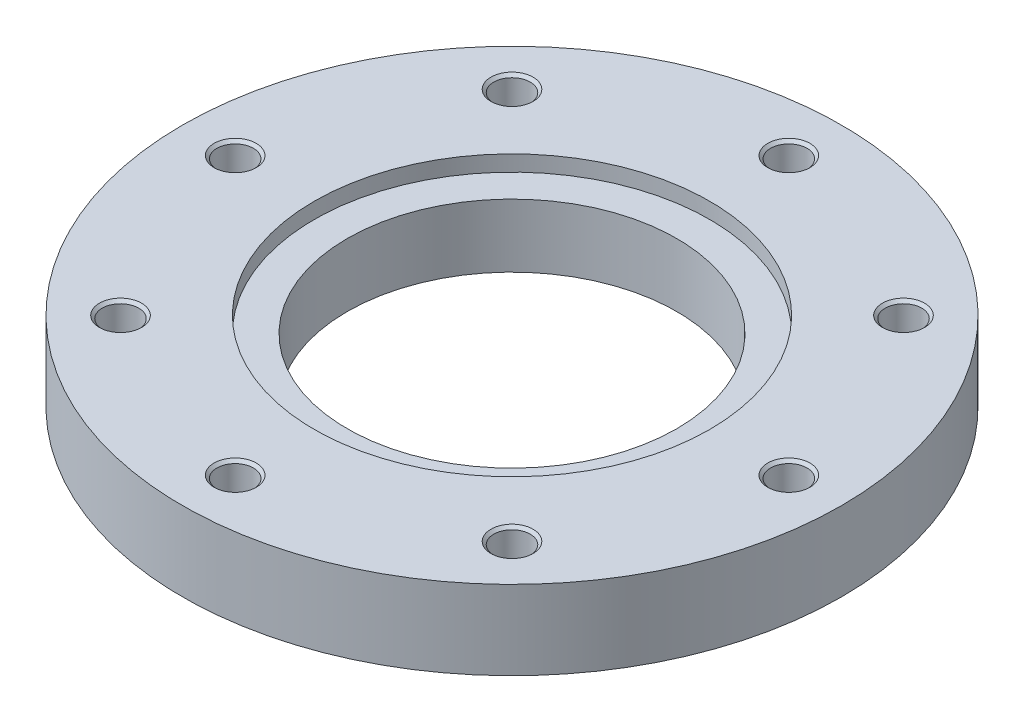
ISO-10303-21;
HEADER;
FILE_DESCRIPTION(('STEP AP214'),'2;1');
FILE_NAME('part.step','',(''),(''),'','','');
FILE_SCHEMA(('AUTOMOTIVE_DESIGN { 1 0 10303 214 1 1 1 1 }'));
ENDSEC;
DATA;
#1=APPLICATION_CONTEXT('core data for automotive mechanical design processes');
#2=APPLICATION_PROTOCOL_DEFINITION('international standard','automotive_design',2000,#1);
#3=PRODUCT_CONTEXT('',#1,'mechanical');
#4=PRODUCT('Part','Part','',(#3));
#5=PRODUCT_RELATED_PRODUCT_CATEGORY('part','',(#4));
#6=PRODUCT_DEFINITION_FORMATION('','',#4);
#7=PRODUCT_DEFINITION_CONTEXT('part definition',#1,'design');
#8=PRODUCT_DEFINITION('design','',#6,#7);
#9=PRODUCT_DEFINITION_SHAPE('','',#8);
#10=(LENGTH_UNIT() NAMED_UNIT(*) SI_UNIT(.MILLI.,.METRE.));
#11=(NAMED_UNIT(*) PLANE_ANGLE_UNIT() SI_UNIT($,.RADIAN.));
#12=(NAMED_UNIT(*) SI_UNIT($,.STERADIAN.) SOLID_ANGLE_UNIT());
#13=UNCERTAINTY_MEASURE_WITH_UNIT(LENGTH_MEASURE(1.E-05),#10,'distance_accuracy_value','');
#14=(GEOMETRIC_REPRESENTATION_CONTEXT(3) GLOBAL_UNCERTAINTY_ASSIGNED_CONTEXT((#13)) GLOBAL_UNIT_ASSIGNED_CONTEXT((#10,
#11,#12)) REPRESENTATION_CONTEXT('',''));
#15=CARTESIAN_POINT('',(0.,0.,0.));
#16=DIRECTION('',(0.,0.,1.));
#17=DIRECTION('',(1.,0.,0.));
#18=AXIS2_PLACEMENT_3D('',#15,#16,#17);
#19=CARTESIAN_POINT('',(0.,15.,0.));
#20=DIRECTION('',(0.,-1.,0.));
#21=DIRECTION('',(1.,0.,0.));
#22=AXIS2_PLACEMENT_3D('',#19,#20,#21);
#23=CYLINDRICAL_SURFACE('',#22,125.);
#24=CARTESIAN_POINT('',(0.,0.,0.));
#25=DIRECTION('',(0.,1.,0.));
#26=DIRECTION('',(1.,0.,0.));
#27=AXIS2_PLACEMENT_3D('',#24,#25,#26);
#28=CIRCLE('',#27,125.);
#29=CARTESIAN_POINT('',(125.,0.,0.));
#30=VERTEX_POINT('',#29);
#31=EDGE_CURVE('E9',#30,#30,#28,.T.);
#32=ORIENTED_EDGE('',*,*,#31,.T.);
#33=EDGE_LOOP('',(#32));
#34=FACE_BOUND('',#33,.T.);
#35=CARTESIAN_POINT('',(0.,30.,0.));
#36=DIRECTION('',(0.,1.,0.));
#37=DIRECTION('',(1.,0.,0.));
#38=AXIS2_PLACEMENT_3D('',#35,#36,#37);
#39=CIRCLE('',#38,125.);
#40=CARTESIAN_POINT('',(125.,30.,0.));
#41=VERTEX_POINT('',#40);
#42=EDGE_CURVE('E149',#41,#41,#39,.T.);
#43=ORIENTED_EDGE('',*,*,#42,.F.);
#44=EDGE_LOOP('',(#43));
#45=FACE_BOUND('',#44,.T.);
#46=ADVANCED_FACE('F15',(#34,#45),#23,.T.);
#47=CARTESIAN_POINT('',(93.75,0.,0.));
#48=DIRECTION('',(0.,-1.,0.));
#49=DIRECTION('',(-1.,0.,0.));
#50=AXIS2_PLACEMENT_3D('',#47,#48,#49);
#51=PLANE('',#50);
#52=CARTESIAN_POINT('',(0.,0.,0.));
#53=DIRECTION('',(0.,1.,0.));
#54=DIRECTION('',(1.,0.,0.));
#55=AXIS2_PLACEMENT_3D('',#52,#53,#54);
#56=CIRCLE('',#55,62.5);
#57=CARTESIAN_POINT('',(62.5,0.,0.));
#58=VERTEX_POINT('',#57);
#59=EDGE_CURVE('E23',#58,#58,#56,.T.);
#60=ORIENTED_EDGE('',*,*,#59,.T.);
#61=EDGE_LOOP('',(#60));
#62=FACE_BOUND('',#61,.T.);
#63=ORIENTED_EDGE('',*,*,#31,.F.);
#64=EDGE_LOOP('',(#63));
#65=FACE_BOUND('',#64,.T.);
#66=ADVANCED_FACE('F234',(#62,#65),#51,.T.);
#67=CARTESIAN_POINT('',(0.,15.,0.));
#68=DIRECTION('',(0.,-1.,0.));
#69=DIRECTION('',(1.,0.,0.));
#70=AXIS2_PLACEMENT_3D('',#67,#68,#69);
#71=CYLINDRICAL_SURFACE('',#70,62.5);
#72=ORIENTED_EDGE('',*,*,#59,.F.);
#73=EDGE_LOOP('',(#72));
#74=FACE_BOUND('',#73,.T.);
#75=CARTESIAN_POINT('',(0.,24.,0.));
#76=DIRECTION('',(0.,1.,0.));
#77=DIRECTION('',(1.,0.,0.));
#78=AXIS2_PLACEMENT_3D('',#75,#76,#77);
#79=CIRCLE('',#78,62.5);
#80=CARTESIAN_POINT('',(-62.5,24.,0.));
#81=VERTEX_POINT('',#80);
#82=EDGE_CURVE('E145',#81,#81,#79,.T.);
#83=ORIENTED_EDGE('',*,*,#82,.T.);
#84=EDGE_LOOP('',(#83));
#85=FACE_BOUND('',#84,.T.);
#86=ADVANCED_FACE('F238',(#74,#85),#71,.F.);
#87=CARTESIAN_POINT('',(93.75,30.,0.));
#88=DIRECTION('',(0.,1.,0.));
#89=DIRECTION('',(1.,0.,0.));
#90=AXIS2_PLACEMENT_3D('',#87,#88,#89);
#91=PLANE('',#90);
#92=ORIENTED_EDGE('',*,*,#42,.T.);
#93=EDGE_LOOP('',(#92));
#94=FACE_BOUND('',#93,.T.);
#95=CARTESIAN_POINT('',(0.,30.,0.));
#96=DIRECTION('',(0.,-1.,0.));
#97=DIRECTION('',(1.,0.,0.));
#98=AXIS2_PLACEMENT_3D('',#95,#96,#97);
#99=CIRCLE('',#98,75.);
#100=CARTESIAN_POINT('',(-75.,30.,0.));
#101=VERTEX_POINT('',#100);
#102=EDGE_CURVE('E246',#101,#101,#99,.T.);
#103=ORIENTED_EDGE('',*,*,#102,.T.);
#104=EDGE_LOOP('',(#103));
#105=FACE_BOUND('',#104,.T.);
#106=CARTESIAN_POINT('',(105.,30.,0.));
#107=DIRECTION('',(0.,-1.,0.));
#108=DIRECTION('',(1.,0.,0.));
#109=AXIS2_PLACEMENT_3D('',#106,#107,#108);
#110=CIRCLE('',#109,8.);
#111=CARTESIAN_POINT('',(113.,30.,0.));
#112=VERTEX_POINT('',#111);
#113=EDGE_CURVE('E254',#112,#112,#110,.T.);
#114=ORIENTED_EDGE('',*,*,#113,.T.);
#115=EDGE_LOOP('',(#114));
#116=FACE_BOUND('',#115,.T.);
#117=CARTESIAN_POINT('',(74.2462120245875,30.,-74.2462120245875));
#118=DIRECTION('',(0.,-1.,0.));
#119=DIRECTION('',(0.707106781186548,0.,-0.707106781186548));
#120=AXIS2_PLACEMENT_3D('',#117,#118,#119);
#121=CIRCLE('',#120,8.);
#122=CARTESIAN_POINT('',(79.9030662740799,30.,-79.9030662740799));
#123=VERTEX_POINT('',#122);
#124=EDGE_CURVE('E265',#123,#123,#121,.T.);
#125=ORIENTED_EDGE('',*,*,#124,.T.);
#126=EDGE_LOOP('',(#125));
#127=FACE_BOUND('',#126,.T.);
#128=CARTESIAN_POINT('',(0.,30.,-105.));
#129=DIRECTION('',(0.,-1.,0.));
#130=DIRECTION('',(0.,0.,-1.));
#131=AXIS2_PLACEMENT_3D('',#128,#129,#130);
#132=CIRCLE('',#131,8.);
#133=CARTESIAN_POINT('',(0.,30.,-113.));
#134=VERTEX_POINT('',#133);
#135=EDGE_CURVE('E276',#134,#134,#132,.T.);
#136=ORIENTED_EDGE('',*,*,#135,.T.);
#137=EDGE_LOOP('',(#136));
#138=FACE_BOUND('',#137,.T.);
#139=CARTESIAN_POINT('',(-74.2462120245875,30.,-74.2462120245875));
#140=DIRECTION('',(0.,-1.,0.));
#141=DIRECTION('',(-0.707106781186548,0.,-0.707106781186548));
#142=AXIS2_PLACEMENT_3D('',#139,#140,#141);
#143=CIRCLE('',#142,8.);
#144=CARTESIAN_POINT('',(-79.9030662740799,30.,-79.9030662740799));
#145=VERTEX_POINT('',#144);
#146=EDGE_CURVE('E289',#145,#145,#143,.T.);
#147=ORIENTED_EDGE('',*,*,#146,.T.);
#148=EDGE_LOOP('',(#147));
#149=FACE_BOUND('',#148,.T.);
#150=CARTESIAN_POINT('',(-105.,30.,0.));
#151=DIRECTION('',(0.,-1.,0.));
#152=DIRECTION('',(-1.,0.,0.));
#153=AXIS2_PLACEMENT_3D('',#150,#151,#152);
#154=CIRCLE('',#153,8.);
#155=CARTESIAN_POINT('',(-113.,30.,0.));
#156=VERTEX_POINT('',#155);
#157=EDGE_CURVE('E304',#156,#156,#154,.T.);
#158=ORIENTED_EDGE('',*,*,#157,.T.);
#159=EDGE_LOOP('',(#158));
#160=FACE_BOUND('',#159,.T.);
#161=CARTESIAN_POINT('',(-74.2462120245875,30.,74.2462120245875));
#162=DIRECTION('',(0.,-1.,0.));
#163=DIRECTION('',(-0.707106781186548,0.,0.707106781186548));
#164=AXIS2_PLACEMENT_3D('',#161,#162,#163);
#165=CIRCLE('',#164,8.);
#166=CARTESIAN_POINT('',(-79.9030662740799,30.,79.9030662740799));
#167=VERTEX_POINT('',#166);
#168=EDGE_CURVE('E316',#167,#167,#165,.T.);
#169=ORIENTED_EDGE('',*,*,#168,.T.);
#170=EDGE_LOOP('',(#169));
#171=FACE_BOUND('',#170,.T.);
#172=CARTESIAN_POINT('',(0.,30.,105.));
#173=DIRECTION('',(0.,-1.,0.));
#174=DIRECTION('',(0.,0.,1.));
#175=AXIS2_PLACEMENT_3D('',#172,#173,#174);
#176=CIRCLE('',#175,8.);
#177=CARTESIAN_POINT('',(0.,30.,113.));
#178=VERTEX_POINT('',#177);
#179=EDGE_CURVE('E324',#178,#178,#176,.T.);
#180=ORIENTED_EDGE('',*,*,#179,.T.);
#181=EDGE_LOOP('',(#180));
#182=FACE_BOUND('',#181,.T.);
#183=CARTESIAN_POINT('',(74.2462120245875,30.,74.2462120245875));
#184=DIRECTION('',(0.,-1.,0.));
#185=DIRECTION('',(0.707106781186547,0.,0.707106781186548));
#186=AXIS2_PLACEMENT_3D('',#183,#184,#185);
#187=CIRCLE('',#186,8.);
#188=CARTESIAN_POINT('',(79.9030662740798,30.,79.9030662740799));
#189=VERTEX_POINT('',#188);
#190=EDGE_CURVE('E336',#189,#189,#187,.T.);
#191=ORIENTED_EDGE('',*,*,#190,.T.);
#192=EDGE_LOOP('',(#191));
#193=FACE_BOUND('',#192,.T.);
#194=ADVANCED_FACE('F345',(#94,#105,#116,#127,#138,#149,#160,#171,#182,#193),#91,.T.);
#195=CARTESIAN_POINT('',(0.,24.,0.));
#196=DIRECTION('',(0.,-1.,0.));
#197=DIRECTION('',(-1.,0.,0.));
#198=AXIS2_PLACEMENT_3D('',#195,#196,#197);
#199=PLANE('',#198);
#200=CARTESIAN_POINT('',(0.,24.,0.));
#201=DIRECTION('',(0.,-1.,0.));
#202=DIRECTION('',(1.,0.,0.));
#203=AXIS2_PLACEMENT_3D('',#200,#201,#202);
#204=CIRCLE('',#203,75.);
#205=CARTESIAN_POINT('',(75.,24.,0.));
#206=VERTEX_POINT('',#205);
#207=EDGE_CURVE('E242',#206,#206,#204,.T.);
#208=ORIENTED_EDGE('',*,*,#207,.F.);
#209=EDGE_LOOP('',(#208));
#210=FACE_BOUND('',#209,.T.);
#211=ORIENTED_EDGE('',*,*,#82,.F.);
#212=EDGE_LOOP('',(#211));
#213=FACE_BOUND('',#212,.T.);
#214=ADVANCED_FACE('F800',(#210,#213),#199,.F.);
#215=CARTESIAN_POINT('',(0.,28.5,0.));
#216=DIRECTION('',(0.,-1.,0.));
#217=DIRECTION('',(1.,0.,0.));
#218=AXIS2_PLACEMENT_3D('',#215,#216,#217);
#219=CYLINDRICAL_SURFACE('',#218,75.);
#220=ORIENTED_EDGE('',*,*,#207,.T.);
#221=EDGE_LOOP('',(#220));
#222=FACE_BOUND('',#221,.T.);
#223=ORIENTED_EDGE('',*,*,#102,.F.);
#224=EDGE_LOOP('',(#223));
#225=FACE_BOUND('',#224,.T.);
#226=ADVANCED_FACE('F791',(#222,#225),#219,.F.);
#227=CARTESIAN_POINT('',(105.,5.00308975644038,0.));
#228=DIRECTION('',(0.,1.,0.));
#229=DIRECTION('',(1.,0.,0.));
#230=AXIS2_PLACEMENT_3D('',#227,#228,#229);
#231=CONICAL_SURFACE('',#230,3.45875,1.0471975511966);
#232=CARTESIAN_POINT('',(105.,7.,0.));
#233=DIRECTION('',(0.,-1.,0.));
#234=DIRECTION('',(1.,0.,0.));
#235=AXIS2_PLACEMENT_3D('',#232,#233,#234);
#236=CIRCLE('',#235,6.9175);
#237=CARTESIAN_POINT('',(111.9175,7.,0.));
#238=VERTEX_POINT('',#237);
#239=EDGE_CURVE('E248',#238,#238,#236,.T.);
#240=ORIENTED_EDGE('',*,*,#239,.F.);
#241=EDGE_LOOP('',(#240));
#242=FACE_BOUND('',#241,.T.);
#243=CARTESIAN_POINT('',(105.,3.00617951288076,0.));
#244=VERTEX_POINT('',#243);
#245=VERTEX_LOOP('',#244);
#246=FACE_BOUND('',#245,.T.);
#247=ADVANCED_FACE('F782',(#242,#246),#231,.F.);
#248=CARTESIAN_POINT('',(105.,9.95875,0.));
#249=DIRECTION('',(0.,1.,0.));
#250=DIRECTION('',(1.,0.,0.));
#251=AXIS2_PLACEMENT_3D('',#248,#249,#250);
#252=CYLINDRICAL_SURFACE('',#251,6.9175);
#253=CARTESIAN_POINT('',(105.,12.9175,0.));
#254=DIRECTION('',(0.,-1.,0.));
#255=DIRECTION('',(1.,0.,0.));
#256=AXIS2_PLACEMENT_3D('',#253,#254,#255);
#257=CIRCLE('',#256,6.9175);
#258=CARTESIAN_POINT('',(111.9175,12.9175,0.));
#259=VERTEX_POINT('',#258);
#260=EDGE_CURVE('E250',#259,#259,#257,.T.);
#261=ORIENTED_EDGE('',*,*,#260,.F.);
#262=EDGE_LOOP('',(#261));
#263=FACE_BOUND('',#262,.T.);
#264=ORIENTED_EDGE('',*,*,#239,.T.);
#265=EDGE_LOOP('',(#264));
#266=FACE_BOUND('',#265,.T.);
#267=ADVANCED_FACE('F773',(#263,#266),#252,.F.);
#268=CARTESIAN_POINT('',(105.,13.45875,0.));
#269=DIRECTION('',(0.,1.,0.));
#270=DIRECTION('',(1.,0.,0.));
#271=AXIS2_PLACEMENT_3D('',#268,#269,#270);
#272=CONICAL_SURFACE('',#271,7.45875,0.785398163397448);
#273=CARTESIAN_POINT('',(105.,14.,0.));
#274=DIRECTION('',(0.,-1.,0.));
#275=DIRECTION('',(1.,0.,0.));
#276=AXIS2_PLACEMENT_3D('',#273,#274,#275);
#277=CIRCLE('',#276,8.);
#278=CARTESIAN_POINT('',(113.,14.,0.));
#279=VERTEX_POINT('',#278);
#280=EDGE_CURVE('E251',#279,#279,#277,.T.);
#281=ORIENTED_EDGE('',*,*,#280,.F.);
#282=EDGE_LOOP('',(#281));
#283=FACE_BOUND('',#282,.T.);
#284=ORIENTED_EDGE('',*,*,#260,.T.);
#285=EDGE_LOOP('',(#284));
#286=FACE_BOUND('',#285,.T.);
#287=ADVANCED_FACE('F764',(#283,#286),#272,.F.);
#288=CARTESIAN_POINT('',(112.45875,14.,0.));
#289=DIRECTION('',(0.,1.,0.));
#290=DIRECTION('',(-1.,0.,0.));
#291=AXIS2_PLACEMENT_3D('',#288,#289,#290);
#292=PLANE('',#291);
#293=CARTESIAN_POINT('',(105.,14.,0.));
#294=DIRECTION('',(0.,-1.,0.));
#295=DIRECTION('',(1.,0.,0.));
#296=AXIS2_PLACEMENT_3D('',#293,#294,#295);
#297=CIRCLE('',#296,6.9175);
#298=CARTESIAN_POINT('',(111.9175,14.,0.));
#299=VERTEX_POINT('',#298);
#300=EDGE_CURVE('E253',#299,#299,#297,.T.);
#301=ORIENTED_EDGE('',*,*,#300,.F.);
#302=EDGE_LOOP('',(#301));
#303=FACE_BOUND('',#302,.T.);
#304=ORIENTED_EDGE('',*,*,#280,.T.);
#305=EDGE_LOOP('',(#304));
#306=FACE_BOUND('',#305,.T.);
#307=ADVANCED_FACE('F755',(#303,#306),#292,.F.);
#308=CARTESIAN_POINT('',(105.,21.45875,0.));
#309=DIRECTION('',(0.,1.,0.));
#310=DIRECTION('',(1.,0.,0.));
#311=AXIS2_PLACEMENT_3D('',#308,#309,#310);
#312=CYLINDRICAL_SURFACE('',#311,6.9175);
#313=CARTESIAN_POINT('',(105.,28.9175,0.));
#314=DIRECTION('',(0.,-1.,0.));
#315=DIRECTION('',(1.,0.,0.));
#316=AXIS2_PLACEMENT_3D('',#313,#314,#315);
#317=CIRCLE('',#316,6.9175);
#318=CARTESIAN_POINT('',(111.9175,28.9175,0.));
#319=VERTEX_POINT('',#318);
#320=EDGE_CURVE('E256',#319,#319,#317,.T.);
#321=ORIENTED_EDGE('',*,*,#320,.F.);
#322=EDGE_LOOP('',(#321));
#323=FACE_BOUND('',#322,.T.);
#324=ORIENTED_EDGE('',*,*,#300,.T.);
#325=EDGE_LOOP('',(#324));
#326=FACE_BOUND('',#325,.T.);
#327=ADVANCED_FACE('F746',(#323,#326),#312,.F.);
#328=CARTESIAN_POINT('',(105.,29.45875,0.));
#329=DIRECTION('',(0.,1.,0.));
#330=DIRECTION('',(1.,0.,0.));
#331=AXIS2_PLACEMENT_3D('',#328,#329,#330);
#332=CONICAL_SURFACE('',#331,7.45875,0.785398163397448);
#333=ORIENTED_EDGE('',*,*,#113,.F.);
#334=EDGE_LOOP('',(#333));
#335=FACE_BOUND('',#334,.T.);
#336=ORIENTED_EDGE('',*,*,#320,.T.);
#337=EDGE_LOOP('',(#336));
#338=FACE_BOUND('',#337,.T.);
#339=ADVANCED_FACE('F737',(#335,#338),#332,.F.);
#340=CARTESIAN_POINT('',(74.2462120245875,5.00308975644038,-74.2462120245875));
#341=DIRECTION('',(0.,1.,0.));
#342=DIRECTION('',(0.707106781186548,0.,-0.707106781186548));
#343=AXIS2_PLACEMENT_3D('',#340,#341,#342);
#344=CONICAL_SURFACE('',#343,3.45875,1.0471975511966);
#345=CARTESIAN_POINT('',(74.2462120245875,7.,-74.2462120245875));
#346=DIRECTION('',(0.,-1.,0.));
#347=DIRECTION('',(0.707106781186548,0.,-0.707106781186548));
#348=AXIS2_PLACEMENT_3D('',#345,#346,#347);
#349=CIRCLE('',#348,6.9175);
#350=CARTESIAN_POINT('',(79.1376231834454,7.,-79.1376231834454));
#351=VERTEX_POINT('',#350);
#352=EDGE_CURVE('E258',#351,#351,#349,.T.);
#353=ORIENTED_EDGE('',*,*,#352,.F.);
#354=EDGE_LOOP('',(#353));
#355=FACE_BOUND('',#354,.T.);
#356=CARTESIAN_POINT('',(74.2462120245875,3.00617951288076,-74.2462120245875));
#357=VERTEX_POINT('',#356);
#358=VERTEX_LOOP('',#357);
#359=FACE_BOUND('',#358,.T.);
#360=ADVANCED_FACE('F728',(#355,#359),#344,.F.);
#361=CARTESIAN_POINT('',(74.2462120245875,9.95875,-74.2462120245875));
#362=DIRECTION('',(0.,1.,0.));
#363=DIRECTION('',(0.707106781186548,0.,-0.707106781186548));
#364=AXIS2_PLACEMENT_3D('',#361,#362,#363);
#365=CYLINDRICAL_SURFACE('',#364,6.9175);
#366=CARTESIAN_POINT('',(74.2462120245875,12.9175,-74.2462120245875));
#367=DIRECTION('',(0.,-1.,0.));
#368=DIRECTION('',(0.707106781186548,0.,-0.707106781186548));
#369=AXIS2_PLACEMENT_3D('',#366,#367,#368);
#370=CIRCLE('',#369,6.9175);
#371=CARTESIAN_POINT('',(79.1376231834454,12.9175,-79.1376231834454));
#372=VERTEX_POINT('',#371);
#373=EDGE_CURVE('E260',#372,#372,#370,.T.);
#374=ORIENTED_EDGE('',*,*,#373,.F.);
#375=EDGE_LOOP('',(#374));
#376=FACE_BOUND('',#375,.T.);
#377=ORIENTED_EDGE('',*,*,#352,.T.);
#378=EDGE_LOOP('',(#377));
#379=FACE_BOUND('',#378,.T.);
#380=ADVANCED_FACE('F719',(#376,#379),#365,.F.);
#381=CARTESIAN_POINT('',(74.2462120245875,13.45875,-74.2462120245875));
#382=DIRECTION('',(0.,1.,0.));
#383=DIRECTION('',(0.707106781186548,0.,-0.707106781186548));
#384=AXIS2_PLACEMENT_3D('',#381,#382,#383);
#385=CONICAL_SURFACE('',#384,7.45875,0.785398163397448);
#386=CARTESIAN_POINT('',(74.2462120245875,14.,-74.2462120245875));
#387=DIRECTION('',(0.,-1.,0.));
#388=DIRECTION('',(0.707106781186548,0.,-0.707106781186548));
#389=AXIS2_PLACEMENT_3D('',#386,#387,#388);
#390=CIRCLE('',#389,8.);
#391=CARTESIAN_POINT('',(79.9030662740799,14.,-79.9030662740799));
#392=VERTEX_POINT('',#391);
#393=EDGE_CURVE('E261',#392,#392,#390,.T.);
#394=ORIENTED_EDGE('',*,*,#393,.F.);
#395=EDGE_LOOP('',(#394));
#396=FACE_BOUND('',#395,.T.);
#397=ORIENTED_EDGE('',*,*,#373,.T.);
#398=EDGE_LOOP('',(#397));
#399=FACE_BOUND('',#398,.T.);
#400=ADVANCED_FACE('F710',(#396,#399),#385,.F.);
#401=CARTESIAN_POINT('',(79.5203447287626,14.,-79.5203447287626));
#402=DIRECTION('',(0.,1.,0.));
#403=DIRECTION('',(-0.707106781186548,0.,0.707106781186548));
#404=AXIS2_PLACEMENT_3D('',#401,#402,#403);
#405=PLANE('',#404);
#406=CARTESIAN_POINT('',(74.2462120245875,14.,-74.2462120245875));
#407=DIRECTION('',(0.,-1.,0.));
#408=DIRECTION('',(0.707106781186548,0.,-0.707106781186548));
#409=AXIS2_PLACEMENT_3D('',#406,#407,#408);
#410=CIRCLE('',#409,6.9175);
#411=CARTESIAN_POINT('',(79.1376231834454,14.,-79.1376231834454));
#412=VERTEX_POINT('',#411);
#413=EDGE_CURVE('E263',#412,#412,#410,.T.);
#414=ORIENTED_EDGE('',*,*,#413,.F.);
#415=EDGE_LOOP('',(#414));
#416=FACE_BOUND('',#415,.T.);
#417=ORIENTED_EDGE('',*,*,#393,.T.);
#418=EDGE_LOOP('',(#417));
#419=FACE_BOUND('',#418,.T.);
#420=ADVANCED_FACE('F701',(#416,#419),#405,.F.);
#421=CARTESIAN_POINT('',(74.2462120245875,21.45875,-74.2462120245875));
#422=DIRECTION('',(0.,1.,0.));
#423=DIRECTION('',(0.707106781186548,0.,-0.707106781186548));
#424=AXIS2_PLACEMENT_3D('',#421,#422,#423);
#425=CYLINDRICAL_SURFACE('',#424,6.9175);
#426=CARTESIAN_POINT('',(74.2462120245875,28.9175,-74.2462120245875));
#427=DIRECTION('',(0.,-1.,0.));
#428=DIRECTION('',(0.707106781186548,0.,-0.707106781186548));
#429=AXIS2_PLACEMENT_3D('',#426,#427,#428);
#430=CIRCLE('',#429,6.9175);
#431=CARTESIAN_POINT('',(79.1376231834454,28.9175,-79.1376231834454));
#432=VERTEX_POINT('',#431);
#433=EDGE_CURVE('E267',#432,#432,#430,.T.);
#434=ORIENTED_EDGE('',*,*,#433,.F.);
#435=EDGE_LOOP('',(#434));
#436=FACE_BOUND('',#435,.T.);
#437=ORIENTED_EDGE('',*,*,#413,.T.);
#438=EDGE_LOOP('',(#437));
#439=FACE_BOUND('',#438,.T.);
#440=ADVANCED_FACE('F692',(#436,#439),#425,.F.);
#441=CARTESIAN_POINT('',(74.2462120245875,29.45875,-74.2462120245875));
#442=DIRECTION('',(0.,1.,0.));
#443=DIRECTION('',(0.707106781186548,0.,-0.707106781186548));
#444=AXIS2_PLACEMENT_3D('',#441,#442,#443);
#445=CONICAL_SURFACE('',#444,7.45875,0.785398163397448);
#446=ORIENTED_EDGE('',*,*,#124,.F.);
#447=EDGE_LOOP('',(#446));
#448=FACE_BOUND('',#447,.T.);
#449=ORIENTED_EDGE('',*,*,#433,.T.);
#450=EDGE_LOOP('',(#449));
#451=FACE_BOUND('',#450,.T.);
#452=ADVANCED_FACE('F683',(#448,#451),#445,.F.);
#453=CARTESIAN_POINT('',(0.,5.00308975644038,-105.));
#454=DIRECTION('',(0.,1.,0.));
#455=DIRECTION('',(0.,0.,-1.));
#456=AXIS2_PLACEMENT_3D('',#453,#454,#455);
#457=CONICAL_SURFACE('',#456,3.45875,1.0471975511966);
#458=CARTESIAN_POINT('',(0.,7.,-105.));
#459=DIRECTION('',(0.,-1.,0.));
#460=DIRECTION('',(0.,0.,-1.));
#461=AXIS2_PLACEMENT_3D('',#458,#459,#460);
#462=CIRCLE('',#461,6.9175);
#463=CARTESIAN_POINT('',(0.,7.,-111.9175));
#464=VERTEX_POINT('',#463);
#465=EDGE_CURVE('E269',#464,#464,#462,.T.);
#466=ORIENTED_EDGE('',*,*,#465,.F.);
#467=EDGE_LOOP('',(#466));
#468=FACE_BOUND('',#467,.T.);
#469=CARTESIAN_POINT('',(0.,3.00617951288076,-105.));
#470=VERTEX_POINT('',#469);
#471=VERTEX_LOOP('',#470);
#472=FACE_BOUND('',#471,.T.);
#473=ADVANCED_FACE('F674',(#468,#472),#457,.F.);
#474=CARTESIAN_POINT('',(0.,9.95875,-105.));
#475=DIRECTION('',(0.,1.,0.));
#476=DIRECTION('',(0.,0.,-1.));
#477=AXIS2_PLACEMENT_3D('',#474,#475,#476);
#478=CYLINDRICAL_SURFACE('',#477,6.9175);
#479=CARTESIAN_POINT('',(0.,12.9175,-105.));
#480=DIRECTION('',(0.,-1.,0.));
#481=DIRECTION('',(0.,0.,-1.));
#482=AXIS2_PLACEMENT_3D('',#479,#480,#481);
#483=CIRCLE('',#482,6.9175);
#484=CARTESIAN_POINT('',(0.,12.9175,-111.9175));
#485=VERTEX_POINT('',#484);
#486=EDGE_CURVE('E271',#485,#485,#483,.T.);
#487=ORIENTED_EDGE('',*,*,#486,.F.);
#488=EDGE_LOOP('',(#487));
#489=FACE_BOUND('',#488,.T.);
#490=ORIENTED_EDGE('',*,*,#465,.T.);
#491=EDGE_LOOP('',(#490));
#492=FACE_BOUND('',#491,.T.);
#493=ADVANCED_FACE('F665',(#489,#492),#478,.F.);
#494=CARTESIAN_POINT('',(0.,13.45875,-105.));
#495=DIRECTION('',(0.,1.,0.));
#496=DIRECTION('',(0.,0.,-1.));
#497=AXIS2_PLACEMENT_3D('',#494,#495,#496);
#498=CONICAL_SURFACE('',#497,7.45875,0.785398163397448);
#499=CARTESIAN_POINT('',(0.,14.,-105.));
#500=DIRECTION('',(0.,-1.,0.));
#501=DIRECTION('',(0.,0.,-1.));
#502=AXIS2_PLACEMENT_3D('',#499,#500,#501);
#503=CIRCLE('',#502,8.);
#504=CARTESIAN_POINT('',(0.,14.,-113.));
#505=VERTEX_POINT('',#504);
#506=EDGE_CURVE('E273',#505,#505,#503,.T.);
#507=ORIENTED_EDGE('',*,*,#506,.F.);
#508=EDGE_LOOP('',(#507));
#509=FACE_BOUND('',#508,.T.);
#510=ORIENTED_EDGE('',*,*,#486,.T.);
#511=EDGE_LOOP('',(#510));
#512=FACE_BOUND('',#511,.T.);
#513=ADVANCED_FACE('F656',(#509,#512),#498,.F.);
#514=CARTESIAN_POINT('',(0.,14.,-112.45875));
#515=DIRECTION('',(0.,1.,0.));
#516=DIRECTION('',(0.,0.,1.));
#517=AXIS2_PLACEMENT_3D('',#514,#515,#516);
#518=PLANE('',#517);
#519=CARTESIAN_POINT('',(0.,14.,-105.));
#520=DIRECTION('',(0.,-1.,0.));
#521=DIRECTION('',(0.,0.,-1.));
#522=AXIS2_PLACEMENT_3D('',#519,#520,#521);
#523=CIRCLE('',#522,6.9175);
#524=CARTESIAN_POINT('',(0.,14.,-111.9175));
#525=VERTEX_POINT('',#524);
#526=EDGE_CURVE('E275',#525,#525,#523,.T.);
#527=ORIENTED_EDGE('',*,*,#526,.F.);
#528=EDGE_LOOP('',(#527));
#529=FACE_BOUND('',#528,.T.);
#530=ORIENTED_EDGE('',*,*,#506,.T.);
#531=EDGE_LOOP('',(#530));
#532=FACE_BOUND('',#531,.T.);
#533=ADVANCED_FACE('F647',(#529,#532),#518,.F.);
#534=CARTESIAN_POINT('',(0.,21.45875,-105.));
#535=DIRECTION('',(0.,1.,0.));
#536=DIRECTION('',(0.,0.,-1.));
#537=AXIS2_PLACEMENT_3D('',#534,#535,#536);
#538=CYLINDRICAL_SURFACE('',#537,6.9175);
#539=CARTESIAN_POINT('',(0.,28.9175,-105.));
#540=DIRECTION('',(0.,-1.,0.));
#541=DIRECTION('',(0.,0.,-1.));
#542=AXIS2_PLACEMENT_3D('',#539,#540,#541);
#543=CIRCLE('',#542,6.9175);
#544=CARTESIAN_POINT('',(0.,28.9175,-111.9175));
#545=VERTEX_POINT('',#544);
#546=EDGE_CURVE('E279',#545,#545,#543,.T.);
#547=ORIENTED_EDGE('',*,*,#546,.F.);
#548=EDGE_LOOP('',(#547));
#549=FACE_BOUND('',#548,.T.);
#550=ORIENTED_EDGE('',*,*,#526,.T.);
#551=EDGE_LOOP('',(#550));
#552=FACE_BOUND('',#551,.T.);
#553=ADVANCED_FACE('F638',(#549,#552),#538,.F.);
#554=CARTESIAN_POINT('',(0.,29.45875,-105.));
#555=DIRECTION('',(0.,1.,0.));
#556=DIRECTION('',(0.,0.,-1.));
#557=AXIS2_PLACEMENT_3D('',#554,#555,#556);
#558=CONICAL_SURFACE('',#557,7.45875,0.785398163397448);
#559=ORIENTED_EDGE('',*,*,#135,.F.);
#560=EDGE_LOOP('',(#559));
#561=FACE_BOUND('',#560,.T.);
#562=ORIENTED_EDGE('',*,*,#546,.T.);
#563=EDGE_LOOP('',(#562));
#564=FACE_BOUND('',#563,.T.);
#565=ADVANCED_FACE('F629',(#561,#564),#558,.F.);
#566=CARTESIAN_POINT('',(-74.2462120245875,5.00308975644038,-74.2462120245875));
#567=DIRECTION('',(0.,1.,0.));
#568=DIRECTION('',(-0.707106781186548,0.,-0.707106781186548));
#569=AXIS2_PLACEMENT_3D('',#566,#567,#568);
#570=CONICAL_SURFACE('',#569,3.45875,1.0471975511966);
#571=CARTESIAN_POINT('',(-74.2462120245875,7.,-74.2462120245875));
#572=DIRECTION('',(0.,-1.,0.));
#573=DIRECTION('',(-0.707106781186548,0.,-0.707106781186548));
#574=AXIS2_PLACEMENT_3D('',#571,#572,#573);
#575=CIRCLE('',#574,6.9175);
#576=CARTESIAN_POINT('',(-79.1376231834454,7.,-79.1376231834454));
#577=VERTEX_POINT('',#576);
#578=EDGE_CURVE('E281',#577,#577,#575,.T.);
#579=ORIENTED_EDGE('',*,*,#578,.F.);
#580=EDGE_LOOP('',(#579));
#581=FACE_BOUND('',#580,.T.);
#582=CARTESIAN_POINT('',(-74.2462120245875,3.00617951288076,-74.2462120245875));
#583=VERTEX_POINT('',#582);
#584=VERTEX_LOOP('',#583);
#585=FACE_BOUND('',#584,.T.);
#586=ADVANCED_FACE('F620',(#581,#585),#570,.F.);
#587=CARTESIAN_POINT('',(-74.2462120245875,9.95875,-74.2462120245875));
#588=DIRECTION('',(0.,1.,0.));
#589=DIRECTION('',(-0.707106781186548,0.,-0.707106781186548));
#590=AXIS2_PLACEMENT_3D('',#587,#588,#589);
#591=CYLINDRICAL_SURFACE('',#590,6.9175);
#592=CARTESIAN_POINT('',(-74.2462120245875,12.9175,-74.2462120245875));
#593=DIRECTION('',(0.,-1.,0.));
#594=DIRECTION('',(-0.707106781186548,0.,-0.707106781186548));
#595=AXIS2_PLACEMENT_3D('',#592,#593,#594);
#596=CIRCLE('',#595,6.9175);
#597=CARTESIAN_POINT('',(-79.1376231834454,12.9175,-79.1376231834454));
#598=VERTEX_POINT('',#597);
#599=EDGE_CURVE('E283',#598,#598,#596,.T.);
#600=ORIENTED_EDGE('',*,*,#599,.F.);
#601=EDGE_LOOP('',(#600));
#602=FACE_BOUND('',#601,.T.);
#603=ORIENTED_EDGE('',*,*,#578,.T.);
#604=EDGE_LOOP('',(#603));
#605=FACE_BOUND('',#604,.T.);
#606=ADVANCED_FACE('F611',(#602,#605),#591,.F.);
#607=CARTESIAN_POINT('',(-74.2462120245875,13.45875,-74.2462120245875));
#608=DIRECTION('',(0.,1.,0.));
#609=DIRECTION('',(-0.707106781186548,0.,-0.707106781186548));
#610=AXIS2_PLACEMENT_3D('',#607,#608,#609);
#611=CONICAL_SURFACE('',#610,7.45875,0.785398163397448);
#612=CARTESIAN_POINT('',(-74.2462120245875,14.,-74.2462120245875));
#613=DIRECTION('',(0.,-1.,0.));
#614=DIRECTION('',(-0.707106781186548,0.,-0.707106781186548));
#615=AXIS2_PLACEMENT_3D('',#612,#613,#614);
#616=CIRCLE('',#615,8.);
#617=CARTESIAN_POINT('',(-79.9030662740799,14.,-79.9030662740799));
#618=VERTEX_POINT('',#617);
#619=EDGE_CURVE('E285',#618,#618,#616,.T.);
#620=ORIENTED_EDGE('',*,*,#619,.F.);
#621=EDGE_LOOP('',(#620));
#622=FACE_BOUND('',#621,.T.);
#623=ORIENTED_EDGE('',*,*,#599,.T.);
#624=EDGE_LOOP('',(#623));
#625=FACE_BOUND('',#624,.T.);
#626=ADVANCED_FACE('F602',(#622,#625),#611,.F.);
#627=CARTESIAN_POINT('',(-79.5203447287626,14.,-79.5203447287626));
#628=DIRECTION('',(0.,1.,0.));
#629=DIRECTION('',(0.707106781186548,0.,0.707106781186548));
#630=AXIS2_PLACEMENT_3D('',#627,#628,#629);
#631=PLANE('',#630);
#632=CARTESIAN_POINT('',(-74.2462120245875,14.,-74.2462120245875));
#633=DIRECTION('',(0.,-1.,0.));
#634=DIRECTION('',(-0.707106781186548,0.,-0.707106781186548));
#635=AXIS2_PLACEMENT_3D('',#632,#633,#634);
#636=CIRCLE('',#635,6.9175);
#637=CARTESIAN_POINT('',(-79.1376231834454,14.,-79.1376231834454));
#638=VERTEX_POINT('',#637);
#639=EDGE_CURVE('E287',#638,#638,#636,.T.);
#640=ORIENTED_EDGE('',*,*,#639,.F.);
#641=EDGE_LOOP('',(#640));
#642=FACE_BOUND('',#641,.T.);
#643=ORIENTED_EDGE('',*,*,#619,.T.);
#644=EDGE_LOOP('',(#643));
#645=FACE_BOUND('',#644,.T.);
#646=ADVANCED_FACE('F593',(#642,#645),#631,.F.);
#647=CARTESIAN_POINT('',(-74.2462120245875,21.45875,-74.2462120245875));
#648=DIRECTION('',(0.,1.,0.));
#649=DIRECTION('',(-0.707106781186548,0.,-0.707106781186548));
#650=AXIS2_PLACEMENT_3D('',#647,#648,#649);
#651=CYLINDRICAL_SURFACE('',#650,6.9175);
#652=CARTESIAN_POINT('',(-74.2462120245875,28.9175,-74.2462120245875));
#653=DIRECTION('',(0.,-1.,0.));
#654=DIRECTION('',(-0.707106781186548,0.,-0.707106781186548));
#655=AXIS2_PLACEMENT_3D('',#652,#653,#654);
#656=CIRCLE('',#655,6.9175);
#657=CARTESIAN_POINT('',(-79.1376231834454,28.9175,-79.1376231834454));
#658=VERTEX_POINT('',#657);
#659=EDGE_CURVE('E292',#658,#658,#656,.T.);
#660=ORIENTED_EDGE('',*,*,#659,.F.);
#661=EDGE_LOOP('',(#660));
#662=FACE_BOUND('',#661,.T.);
#663=ORIENTED_EDGE('',*,*,#639,.T.);
#664=EDGE_LOOP('',(#663));
#665=FACE_BOUND('',#664,.T.);
#666=ADVANCED_FACE('F584',(#662,#665),#651,.F.);
#667=CARTESIAN_POINT('',(-74.2462120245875,29.45875,-74.2462120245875));
#668=DIRECTION('',(0.,1.,0.));
#669=DIRECTION('',(-0.707106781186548,0.,-0.707106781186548));
#670=AXIS2_PLACEMENT_3D('',#667,#668,#669);
#671=CONICAL_SURFACE('',#670,7.45875,0.785398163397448);
#672=ORIENTED_EDGE('',*,*,#146,.F.);
#673=EDGE_LOOP('',(#672));
#674=FACE_BOUND('',#673,.T.);
#675=ORIENTED_EDGE('',*,*,#659,.T.);
#676=EDGE_LOOP('',(#675));
#677=FACE_BOUND('',#676,.T.);
#678=ADVANCED_FACE('F575',(#674,#677),#671,.F.);
#679=CARTESIAN_POINT('',(-105.,5.00308975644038,0.));
#680=DIRECTION('',(0.,1.,0.));
#681=DIRECTION('',(-1.,0.,0.));
#682=AXIS2_PLACEMENT_3D('',#679,#680,#681);
#683=CONICAL_SURFACE('',#682,3.45875,1.0471975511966);
#684=CARTESIAN_POINT('',(-105.,7.,0.));
#685=DIRECTION('',(0.,-1.,0.));
#686=DIRECTION('',(-1.,0.,0.));
#687=AXIS2_PLACEMENT_3D('',#684,#685,#686);
#688=CIRCLE('',#687,6.9175);
#689=CARTESIAN_POINT('',(-111.9175,7.,0.));
#690=VERTEX_POINT('',#689);
#691=EDGE_CURVE('E295',#690,#690,#688,.T.);
#692=ORIENTED_EDGE('',*,*,#691,.F.);
#693=EDGE_LOOP('',(#692));
#694=FACE_BOUND('',#693,.T.);
#695=CARTESIAN_POINT('',(-105.,3.00617951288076,0.));
#696=VERTEX_POINT('',#695);
#697=VERTEX_LOOP('',#696);
#698=FACE_BOUND('',#697,.T.);
#699=ADVANCED_FACE('F566',(#694,#698),#683,.F.);
#700=CARTESIAN_POINT('',(-105.,9.95875,0.));
#701=DIRECTION('',(0.,1.,0.));
#702=DIRECTION('',(-1.,0.,0.));
#703=AXIS2_PLACEMENT_3D('',#700,#701,#702);
#704=CYLINDRICAL_SURFACE('',#703,6.9175);
#705=CARTESIAN_POINT('',(-105.,12.9175,0.));
#706=DIRECTION('',(0.,-1.,0.));
#707=DIRECTION('',(-1.,0.,0.));
#708=AXIS2_PLACEMENT_3D('',#705,#706,#707);
#709=CIRCLE('',#708,6.9175);
#710=CARTESIAN_POINT('',(-111.9175,12.9175,0.));
#711=VERTEX_POINT('',#710);
#712=EDGE_CURVE('E297',#711,#711,#709,.T.);
#713=ORIENTED_EDGE('',*,*,#712,.F.);
#714=EDGE_LOOP('',(#713));
#715=FACE_BOUND('',#714,.T.);
#716=ORIENTED_EDGE('',*,*,#691,.T.);
#717=EDGE_LOOP('',(#716));
#718=FACE_BOUND('',#717,.T.);
#719=ADVANCED_FACE('F557',(#715,#718),#704,.F.);
#720=CARTESIAN_POINT('',(-105.,13.45875,0.));
#721=DIRECTION('',(0.,1.,0.));
#722=DIRECTION('',(-1.,0.,0.));
#723=AXIS2_PLACEMENT_3D('',#720,#721,#722);
#724=CONICAL_SURFACE('',#723,7.45875,0.785398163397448);
#725=CARTESIAN_POINT('',(-105.,14.,0.));
#726=DIRECTION('',(0.,-1.,0.));
#727=DIRECTION('',(-1.,0.,0.));
#728=AXIS2_PLACEMENT_3D('',#725,#726,#727);
#729=CIRCLE('',#728,8.);
#730=CARTESIAN_POINT('',(-113.,14.,0.));
#731=VERTEX_POINT('',#730);
#732=EDGE_CURVE('E299',#731,#731,#729,.T.);
#733=ORIENTED_EDGE('',*,*,#732,.F.);
#734=EDGE_LOOP('',(#733));
#735=FACE_BOUND('',#734,.T.);
#736=ORIENTED_EDGE('',*,*,#712,.T.);
#737=EDGE_LOOP('',(#736));
#738=FACE_BOUND('',#737,.T.);
#739=ADVANCED_FACE('F548',(#735,#738),#724,.F.);
#740=CARTESIAN_POINT('',(-112.45875,14.,0.));
#741=DIRECTION('',(0.,1.,0.));
#742=DIRECTION('',(1.,0.,0.));
#743=AXIS2_PLACEMENT_3D('',#740,#741,#742);
#744=PLANE('',#743);
#745=CARTESIAN_POINT('',(-105.,14.,0.));
#746=DIRECTION('',(0.,-1.,0.));
#747=DIRECTION('',(-1.,0.,0.));
#748=AXIS2_PLACEMENT_3D('',#745,#746,#747);
#749=CIRCLE('',#748,6.9175);
#750=CARTESIAN_POINT('',(-111.9175,14.,0.));
#751=VERTEX_POINT('',#750);
#752=EDGE_CURVE('E302',#751,#751,#749,.T.);
#753=ORIENTED_EDGE('',*,*,#752,.F.);
#754=EDGE_LOOP('',(#753));
#755=FACE_BOUND('',#754,.T.);
#756=ORIENTED_EDGE('',*,*,#732,.T.);
#757=EDGE_LOOP('',(#756));
#758=FACE_BOUND('',#757,.T.);
#759=ADVANCED_FACE('F539',(#755,#758),#744,.F.);
#760=CARTESIAN_POINT('',(-105.,21.45875,0.));
#761=DIRECTION('',(0.,1.,0.));
#762=DIRECTION('',(-1.,0.,0.));
#763=AXIS2_PLACEMENT_3D('',#760,#761,#762);
#764=CYLINDRICAL_SURFACE('',#763,6.9175);
#765=CARTESIAN_POINT('',(-105.,28.9175,0.));
#766=DIRECTION('',(0.,-1.,0.));
#767=DIRECTION('',(-1.,0.,0.));
#768=AXIS2_PLACEMENT_3D('',#765,#766,#767);
#769=CIRCLE('',#768,6.9175);
#770=CARTESIAN_POINT('',(-111.9175,28.9175,0.));
#771=VERTEX_POINT('',#770);
#772=EDGE_CURVE('E306',#771,#771,#769,.T.);
#773=ORIENTED_EDGE('',*,*,#772,.F.);
#774=EDGE_LOOP('',(#773));
#775=FACE_BOUND('',#774,.T.);
#776=ORIENTED_EDGE('',*,*,#752,.T.);
#777=EDGE_LOOP('',(#776));
#778=FACE_BOUND('',#777,.T.);
#779=ADVANCED_FACE('F229',(#775,#778),#764,.F.);
#780=CARTESIAN_POINT('',(-105.,29.45875,0.));
#781=DIRECTION('',(0.,1.,0.));
#782=DIRECTION('',(-1.,0.,0.));
#783=AXIS2_PLACEMENT_3D('',#780,#781,#782);
#784=CONICAL_SURFACE('',#783,7.45875,0.785398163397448);
#785=ORIENTED_EDGE('',*,*,#157,.F.);
#786=EDGE_LOOP('',(#785));
#787=FACE_BOUND('',#786,.T.);
#788=ORIENTED_EDGE('',*,*,#772,.T.);
#789=EDGE_LOOP('',(#788));
#790=FACE_BOUND('',#789,.T.);
#791=ADVANCED_FACE('F218',(#787,#790),#784,.F.);
#792=CARTESIAN_POINT('',(-74.2462120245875,5.00308975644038,74.2462120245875));
#793=DIRECTION('',(0.,1.,0.));
#794=DIRECTION('',(-0.707106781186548,0.,0.707106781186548));
#795=AXIS2_PLACEMENT_3D('',#792,#793,#794);
#796=CONICAL_SURFACE('',#795,3.45875,1.0471975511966);
#797=CARTESIAN_POINT('',(-74.2462120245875,7.,74.2462120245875));
#798=DIRECTION('',(0.,-1.,0.));
#799=DIRECTION('',(-0.707106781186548,0.,0.707106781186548));
#800=AXIS2_PLACEMENT_3D('',#797,#798,#799);
#801=CIRCLE('',#800,6.9175);
#802=CARTESIAN_POINT('',(-79.1376231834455,7.,79.1376231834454));
#803=VERTEX_POINT('',#802);
#804=EDGE_CURVE('E308',#803,#803,#801,.T.);
#805=ORIENTED_EDGE('',*,*,#804,.F.);
#806=EDGE_LOOP('',(#805));
#807=FACE_BOUND('',#806,.T.);
#808=CARTESIAN_POINT('',(-74.2462120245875,3.00617951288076,74.2462120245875));
#809=VERTEX_POINT('',#808);
#810=VERTEX_LOOP('',#809);
#811=FACE_BOUND('',#810,.T.);
#812=ADVANCED_FACE('F215',(#807,#811),#796,.F.);
#813=CARTESIAN_POINT('',(-74.2462120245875,9.95875,74.2462120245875));
#814=DIRECTION('',(0.,1.,0.));
#815=DIRECTION('',(-0.707106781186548,0.,0.707106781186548));
#816=AXIS2_PLACEMENT_3D('',#813,#814,#815);
#817=CYLINDRICAL_SURFACE('',#816,6.9175);
#818=CARTESIAN_POINT('',(-74.2462120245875,12.9175,74.2462120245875));
#819=DIRECTION('',(0.,-1.,0.));
#820=DIRECTION('',(-0.707106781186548,0.,0.707106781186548));
#821=AXIS2_PLACEMENT_3D('',#818,#819,#820);
#822=CIRCLE('',#821,6.9175);
#823=CARTESIAN_POINT('',(-79.1376231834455,12.9175,79.1376231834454));
#824=VERTEX_POINT('',#823);
#825=EDGE_CURVE('E310',#824,#824,#822,.T.);
#826=ORIENTED_EDGE('',*,*,#825,.F.);
#827=EDGE_LOOP('',(#826));
#828=FACE_BOUND('',#827,.T.);
#829=ORIENTED_EDGE('',*,*,#804,.T.);
#830=EDGE_LOOP('',(#829));
#831=FACE_BOUND('',#830,.T.);
#832=ADVANCED_FACE('F217',(#828,#831),#817,.F.);
#833=CARTESIAN_POINT('',(-74.2462120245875,13.45875,74.2462120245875));
#834=DIRECTION('',(0.,1.,0.));
#835=DIRECTION('',(-0.707106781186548,0.,0.707106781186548));
#836=AXIS2_PLACEMENT_3D('',#833,#834,#835);
#837=CONICAL_SURFACE('',#836,7.45875,0.785398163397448);
#838=CARTESIAN_POINT('',(-74.2462120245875,14.,74.2462120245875));
#839=DIRECTION('',(0.,-1.,0.));
#840=DIRECTION('',(-0.707106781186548,0.,0.707106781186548));
#841=AXIS2_PLACEMENT_3D('',#838,#839,#840);
#842=CIRCLE('',#841,8.);
#843=CARTESIAN_POINT('',(-79.9030662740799,14.,79.9030662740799));
#844=VERTEX_POINT('',#843);
#845=EDGE_CURVE('E312',#844,#844,#842,.T.);
#846=ORIENTED_EDGE('',*,*,#845,.F.);
#847=EDGE_LOOP('',(#846));
#848=FACE_BOUND('',#847,.T.);
#849=ORIENTED_EDGE('',*,*,#825,.T.);
#850=EDGE_LOOP('',(#849));
#851=FACE_BOUND('',#850,.T.);
#852=ADVANCED_FACE('F226',(#848,#851),#837,.F.);
#853=CARTESIAN_POINT('',(-79.5203447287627,14.,79.5203447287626));
#854=DIRECTION('',(0.,1.,0.));
#855=DIRECTION('',(0.707106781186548,0.,-0.707106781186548));
#856=AXIS2_PLACEMENT_3D('',#853,#854,#855);
#857=PLANE('',#856);
#858=CARTESIAN_POINT('',(-74.2462120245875,14.,74.2462120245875));
#859=DIRECTION('',(0.,-1.,0.));
#860=DIRECTION('',(-0.707106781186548,0.,0.707106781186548));
#861=AXIS2_PLACEMENT_3D('',#858,#859,#860);
#862=CIRCLE('',#861,6.9175);
#863=CARTESIAN_POINT('',(-79.1376231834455,14.,79.1376231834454));
#864=VERTEX_POINT('',#863);
#865=EDGE_CURVE('E314',#864,#864,#862,.T.);
#866=ORIENTED_EDGE('',*,*,#865,.F.);
#867=EDGE_LOOP('',(#866));
#868=FACE_BOUND('',#867,.T.);
#869=ORIENTED_EDGE('',*,*,#845,.T.);
#870=EDGE_LOOP('',(#869));
#871=FACE_BOUND('',#870,.T.);
#872=ADVANCED_FACE('F358',(#868,#871),#857,.F.);
#873=CARTESIAN_POINT('',(-74.2462120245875,21.45875,74.2462120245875));
#874=DIRECTION('',(0.,1.,0.));
#875=DIRECTION('',(-0.707106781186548,0.,0.707106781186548));
#876=AXIS2_PLACEMENT_3D('',#873,#874,#875);
#877=CYLINDRICAL_SURFACE('',#876,6.9175);
#878=CARTESIAN_POINT('',(-74.2462120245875,28.9175,74.2462120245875));
#879=DIRECTION('',(0.,-1.,0.));
#880=DIRECTION('',(-0.707106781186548,0.,0.707106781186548));
#881=AXIS2_PLACEMENT_3D('',#878,#879,#880);
#882=CIRCLE('',#881,6.9175);
#883=CARTESIAN_POINT('',(-79.1376231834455,28.9175,79.1376231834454));
#884=VERTEX_POINT('',#883);
#885=EDGE_CURVE('E325',#884,#884,#882,.T.);
#886=ORIENTED_EDGE('',*,*,#885,.F.);
#887=EDGE_LOOP('',(#886));
#888=FACE_BOUND('',#887,.T.);
#889=ORIENTED_EDGE('',*,*,#865,.T.);
#890=EDGE_LOOP('',(#889));
#891=FACE_BOUND('',#890,.T.);
#892=ADVANCED_FACE('F352',(#888,#891),#877,.F.);
#893=CARTESIAN_POINT('',(-74.2462120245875,29.45875,74.2462120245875));
#894=DIRECTION('',(0.,1.,0.));
#895=DIRECTION('',(-0.707106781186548,0.,0.707106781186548));
#896=AXIS2_PLACEMENT_3D('',#893,#894,#895);
#897=CONICAL_SURFACE('',#896,7.45875,0.785398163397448);
#898=ORIENTED_EDGE('',*,*,#168,.F.);
#899=EDGE_LOOP('',(#898));
#900=FACE_BOUND('',#899,.T.);
#901=ORIENTED_EDGE('',*,*,#885,.T.);
#902=EDGE_LOOP('',(#901));
#903=FACE_BOUND('',#902,.T.);
#904=ADVANCED_FACE('F348',(#900,#903),#897,.F.);
#905=CARTESIAN_POINT('',(0.,5.00308975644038,105.));
#906=DIRECTION('',(0.,1.,0.));
#907=DIRECTION('',(0.,0.,1.));
#908=AXIS2_PLACEMENT_3D('',#905,#906,#907);
#909=CONICAL_SURFACE('',#908,3.45875,1.0471975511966);
#910=CARTESIAN_POINT('',(0.,7.,105.));
#911=DIRECTION('',(0.,-1.,0.));
#912=DIRECTION('',(0.,0.,1.));
#913=AXIS2_PLACEMENT_3D('',#910,#911,#912);
#914=CIRCLE('',#913,6.9175);
#915=CARTESIAN_POINT('',(0.,7.,111.9175));
#916=VERTEX_POINT('',#915);
#917=EDGE_CURVE('E319',#916,#916,#914,.T.);
#918=ORIENTED_EDGE('',*,*,#917,.F.);
#919=EDGE_LOOP('',(#918));
#920=FACE_BOUND('',#919,.T.);
#921=CARTESIAN_POINT('',(0.,3.00617951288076,105.));
#922=VERTEX_POINT('',#921);
#923=VERTEX_LOOP('',#922);
#924=FACE_BOUND('',#923,.T.);
#925=ADVANCED_FACE('F351',(#920,#924),#909,.F.);
#926=CARTESIAN_POINT('',(0.,9.95875,105.));
#927=DIRECTION('',(0.,1.,0.));
#928=DIRECTION('',(0.,0.,1.));
#929=AXIS2_PLACEMENT_3D('',#926,#927,#928);
#930=CYLINDRICAL_SURFACE('',#929,6.9175);
#931=CARTESIAN_POINT('',(0.,12.9175,105.));
#932=DIRECTION('',(0.,-1.,0.));
#933=DIRECTION('',(0.,0.,1.));
#934=AXIS2_PLACEMENT_3D('',#931,#932,#933);
#935=CIRCLE('',#934,6.9175);
#936=CARTESIAN_POINT('',(0.,12.9175,111.9175));
#937=VERTEX_POINT('',#936);
#938=EDGE_CURVE('E317',#937,#937,#935,.T.);
#939=ORIENTED_EDGE('',*,*,#938,.F.);
#940=EDGE_LOOP('',(#939));
#941=FACE_BOUND('',#940,.T.);
#942=ORIENTED_EDGE('',*,*,#917,.T.);
#943=EDGE_LOOP('',(#942));
#944=FACE_BOUND('',#943,.T.);
#945=ADVANCED_FACE('F379',(#941,#944),#930,.F.);
#946=CARTESIAN_POINT('',(0.,13.45875,105.));
#947=DIRECTION('',(0.,1.,0.));
#948=DIRECTION('',(0.,0.,1.));
#949=AXIS2_PLACEMENT_3D('',#946,#947,#948);
#950=CONICAL_SURFACE('',#949,7.45875,0.785398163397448);
#951=CARTESIAN_POINT('',(0.,14.,105.));
#952=DIRECTION('',(0.,-1.,0.));
#953=DIRECTION('',(0.,0.,1.));
#954=AXIS2_PLACEMENT_3D('',#951,#952,#953);
#955=CIRCLE('',#954,8.);
#956=CARTESIAN_POINT('',(0.,14.,113.));
#957=VERTEX_POINT('',#956);
#958=EDGE_CURVE('E320',#957,#957,#955,.T.);
#959=ORIENTED_EDGE('',*,*,#958,.F.);
#960=EDGE_LOOP('',(#959));
#961=FACE_BOUND('',#960,.T.);
#962=ORIENTED_EDGE('',*,*,#938,.T.);
#963=EDGE_LOOP('',(#962));
#964=FACE_BOUND('',#963,.T.);
#965=ADVANCED_FACE('F375',(#961,#964),#950,.F.);
#966=CARTESIAN_POINT('',(0.,14.,112.45875));
#967=DIRECTION('',(0.,1.,0.));
#968=DIRECTION('',(0.,0.,-1.));
#969=AXIS2_PLACEMENT_3D('',#966,#967,#968);
#970=PLANE('',#969);
#971=CARTESIAN_POINT('',(0.,14.,105.));
#972=DIRECTION('',(0.,-1.,0.));
#973=DIRECTION('',(0.,0.,1.));
#974=AXIS2_PLACEMENT_3D('',#971,#972,#973);
#975=CIRCLE('',#974,6.9175);
#976=CARTESIAN_POINT('',(0.,14.,111.9175));
#977=VERTEX_POINT('',#976);
#978=EDGE_CURVE('E322',#977,#977,#975,.T.);
#979=ORIENTED_EDGE('',*,*,#978,.F.);
#980=EDGE_LOOP('',(#979));
#981=FACE_BOUND('',#980,.T.);
#982=ORIENTED_EDGE('',*,*,#958,.T.);
#983=EDGE_LOOP('',(#982));
#984=FACE_BOUND('',#983,.T.);
#985=ADVANCED_FACE('F378',(#981,#984),#970,.F.);
#986=CARTESIAN_POINT('',(0.,21.45875,105.));
#987=DIRECTION('',(0.,1.,0.));
#988=DIRECTION('',(0.,0.,1.));
#989=AXIS2_PLACEMENT_3D('',#986,#987,#988);
#990=CYLINDRICAL_SURFACE('',#989,6.9175);
#991=CARTESIAN_POINT('',(0.,28.9175,105.));
#992=DIRECTION('',(0.,-1.,0.));
#993=DIRECTION('',(0.,0.,1.));
#994=AXIS2_PLACEMENT_3D('',#991,#992,#993);
#995=CIRCLE('',#994,6.9175);
#996=CARTESIAN_POINT('',(0.,28.9175,111.9175));
#997=VERTEX_POINT('',#996);
#998=EDGE_CURVE('E329',#997,#997,#995,.T.);
#999=ORIENTED_EDGE('',*,*,#998,.F.);
#1000=EDGE_LOOP('',(#999));
#1001=FACE_BOUND('',#1000,.T.);
#1002=ORIENTED_EDGE('',*,*,#978,.T.);
#1003=EDGE_LOOP('',(#1002));
#1004=FACE_BOUND('',#1003,.T.);
#1005=ADVANCED_FACE('F383',(#1001,#1004),#990,.F.);
#1006=CARTESIAN_POINT('',(0.,29.45875,105.));
#1007=DIRECTION('',(0.,1.,0.));
#1008=DIRECTION('',(0.,0.,1.));
#1009=AXIS2_PLACEMENT_3D('',#1006,#1007,#1008);
#1010=CONICAL_SURFACE('',#1009,7.45875,0.785398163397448);
#1011=ORIENTED_EDGE('',*,*,#179,.F.);
#1012=EDGE_LOOP('',(#1011));
#1013=FACE_BOUND('',#1012,.T.);
#1014=ORIENTED_EDGE('',*,*,#998,.T.);
#1015=EDGE_LOOP('',(#1014));
#1016=FACE_BOUND('',#1015,.T.);
#1017=ADVANCED_FACE('F386',(#1013,#1016),#1010,.F.);
#1018=CARTESIAN_POINT('',(74.2462120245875,5.00308975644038,74.2462120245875));
#1019=DIRECTION('',(0.,1.,0.));
#1020=DIRECTION('',(0.707106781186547,0.,0.707106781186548));
#1021=AXIS2_PLACEMENT_3D('',#1018,#1019,#1020);
#1022=CONICAL_SURFACE('',#1021,3.45875,1.0471975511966);
#1023=CARTESIAN_POINT('',(74.2462120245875,7.,74.2462120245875));
#1024=DIRECTION('',(0.,-1.,0.));
#1025=DIRECTION('',(0.707106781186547,0.,0.707106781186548));
#1026=AXIS2_PLACEMENT_3D('',#1023,#1024,#1025);
#1027=CIRCLE('',#1026,6.9175);
#1028=CARTESIAN_POINT('',(79.1376231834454,7.,79.1376231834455));
#1029=VERTEX_POINT('',#1028);
#1030=EDGE_CURVE('E327',#1029,#1029,#1027,.T.);
#1031=ORIENTED_EDGE('',*,*,#1030,.F.);
#1032=EDGE_LOOP('',(#1031));
#1033=FACE_BOUND('',#1032,.T.);
#1034=CARTESIAN_POINT('',(74.2462120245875,3.00617951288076,74.2462120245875));
#1035=VERTEX_POINT('',#1034);
#1036=VERTEX_LOOP('',#1035);
#1037=FACE_BOUND('',#1036,.T.);
#1038=ADVANCED_FACE('F389',(#1033,#1037),#1022,.F.);
#1039=CARTESIAN_POINT('',(74.2462120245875,9.95875,74.2462120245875));
#1040=DIRECTION('',(0.,1.,0.));
#1041=DIRECTION('',(0.707106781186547,0.,0.707106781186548));
#1042=AXIS2_PLACEMENT_3D('',#1039,#1040,#1041);
#1043=CYLINDRICAL_SURFACE('',#1042,6.9175);
#1044=CARTESIAN_POINT('',(74.2462120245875,12.9175,74.2462120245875));
#1045=DIRECTION('',(0.,-1.,0.));
#1046=DIRECTION('',(0.707106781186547,0.,0.707106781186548));
#1047=AXIS2_PLACEMENT_3D('',#1044,#1045,#1046);
#1048=CIRCLE('',#1047,6.9175);
#1049=CARTESIAN_POINT('',(79.1376231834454,12.9175,79.1376231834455));
#1050=VERTEX_POINT('',#1049);
#1051=EDGE_CURVE('E330',#1050,#1050,#1048,.T.);
#1052=ORIENTED_EDGE('',*,*,#1051,.F.);
#1053=EDGE_LOOP('',(#1052));
#1054=FACE_BOUND('',#1053,.T.);
#1055=ORIENTED_EDGE('',*,*,#1030,.T.);
#1056=EDGE_LOOP('',(#1055));
#1057=FACE_BOUND('',#1056,.T.);
#1058=ADVANCED_FACE('F392',(#1054,#1057),#1043,.F.);
#1059=CARTESIAN_POINT('',(74.2462120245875,13.45875,74.2462120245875));
#1060=DIRECTION('',(0.,1.,0.));
#1061=DIRECTION('',(0.707106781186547,0.,0.707106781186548));
#1062=AXIS2_PLACEMENT_3D('',#1059,#1060,#1061);
#1063=CONICAL_SURFACE('',#1062,7.45875,0.785398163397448);
#1064=CARTESIAN_POINT('',(74.2462120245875,14.,74.2462120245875));
#1065=DIRECTION('',(0.,-1.,0.));
#1066=DIRECTION('',(0.707106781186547,0.,0.707106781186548));
#1067=AXIS2_PLACEMENT_3D('',#1064,#1065,#1066);
#1068=CIRCLE('',#1067,8.);
#1069=CARTESIAN_POINT('',(79.9030662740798,14.,79.9030662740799));
#1070=VERTEX_POINT('',#1069);
#1071=EDGE_CURVE('E333',#1070,#1070,#1068,.T.);
#1072=ORIENTED_EDGE('',*,*,#1071,.F.);
#1073=EDGE_LOOP('',(#1072));
#1074=FACE_BOUND('',#1073,.T.);
#1075=ORIENTED_EDGE('',*,*,#1051,.T.);
#1076=EDGE_LOOP('',(#1075));
#1077=FACE_BOUND('',#1076,.T.);
#1078=ADVANCED_FACE('F396',(#1074,#1077),#1063,.F.);
#1079=CARTESIAN_POINT('',(79.5203447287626,14.,79.5203447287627));
#1080=DIRECTION('',(0.,1.,0.));
#1081=DIRECTION('',(-0.707106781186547,0.,-0.707106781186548));
#1082=AXIS2_PLACEMENT_3D('',#1079,#1080,#1081);
#1083=PLANE('',#1082);
#1084=CARTESIAN_POINT('',(74.2462120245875,14.,74.2462120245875));
#1085=DIRECTION('',(0.,-1.,0.));
#1086=DIRECTION('',(0.707106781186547,0.,0.707106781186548));
#1087=AXIS2_PLACEMENT_3D('',#1084,#1085,#1086);
#1088=CIRCLE('',#1087,6.9175);
#1089=CARTESIAN_POINT('',(79.1376231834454,14.,79.1376231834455));
#1090=VERTEX_POINT('',#1089);
#1091=EDGE_CURVE('E335',#1090,#1090,#1088,.T.);
#1092=ORIENTED_EDGE('',*,*,#1091,.F.);
#1093=EDGE_LOOP('',(#1092));
#1094=FACE_BOUND('',#1093,.T.);
#1095=ORIENTED_EDGE('',*,*,#1071,.T.);
#1096=EDGE_LOOP('',(#1095));
#1097=FACE_BOUND('',#1096,.T.);
#1098=ADVANCED_FACE('F398',(#1094,#1097),#1083,.F.);
#1099=CARTESIAN_POINT('',(74.2462120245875,21.45875,74.2462120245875));
#1100=DIRECTION('',(0.,1.,0.));
#1101=DIRECTION('',(0.707106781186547,0.,0.707106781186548));
#1102=AXIS2_PLACEMENT_3D('',#1099,#1100,#1101);
#1103=CYLINDRICAL_SURFACE('',#1102,6.9175);
#1104=CARTESIAN_POINT('',(74.2462120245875,28.9175,74.2462120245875));
#1105=DIRECTION('',(0.,-1.,0.));
#1106=DIRECTION('',(0.707106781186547,0.,0.707106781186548));
#1107=AXIS2_PLACEMENT_3D('',#1104,#1105,#1106);
#1108=CIRCLE('',#1107,6.9175);
#1109=CARTESIAN_POINT('',(79.1376231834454,28.9175,79.1376231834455));
#1110=VERTEX_POINT('',#1109);
#1111=EDGE_CURVE('E338',#1110,#1110,#1108,.T.);
#1112=ORIENTED_EDGE('',*,*,#1111,.F.);
#1113=EDGE_LOOP('',(#1112));
#1114=FACE_BOUND('',#1113,.T.);
#1115=ORIENTED_EDGE('',*,*,#1091,.T.);
#1116=EDGE_LOOP('',(#1115));
#1117=FACE_BOUND('',#1116,.T.);
#1118=ADVANCED_FACE('F401',(#1114,#1117),#1103,.F.);
#1119=CARTESIAN_POINT('',(74.2462120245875,29.45875,74.2462120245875));
#1120=DIRECTION('',(0.,1.,0.));
#1121=DIRECTION('',(0.707106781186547,0.,0.707106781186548));
#1122=AXIS2_PLACEMENT_3D('',#1119,#1120,#1121);
#1123=CONICAL_SURFACE('',#1122,7.45875,0.785398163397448);
#1124=ORIENTED_EDGE('',*,*,#190,.F.);
#1125=EDGE_LOOP('',(#1124));
#1126=FACE_BOUND('',#1125,.T.);
#1127=ORIENTED_EDGE('',*,*,#1111,.T.);
#1128=EDGE_LOOP('',(#1127));
#1129=FACE_BOUND('',#1128,.T.);
#1130=ADVANCED_FACE('F408',(#1126,#1129),#1123,.F.);
#1131=CLOSED_SHELL('',(#46,#66,#86,#194,#214,#226,#247,#267,#287,#307,#327,#339,#360,#380,#400,
#420,#440,#452,#473,#493,#513,#533,#553,#565,#586,#606,#626,#646,#666,#678,#699,#719,#739,#759,
#779,#791,#812,#832,#852,#872,#892,#904,#925,#945,#965,#985,#1005,#1017,#1038,#1058,#1078,#1098,
#1118,#1130));
#1132=MANIFOLD_SOLID_BREP('B1',#1131);
#1133=ADVANCED_BREP_SHAPE_REPRESENTATION('',(#18,#1132),#14);
#1134=SHAPE_DEFINITION_REPRESENTATION(#9,#1133);
ENDSEC;
END-ISO-10303-21;
